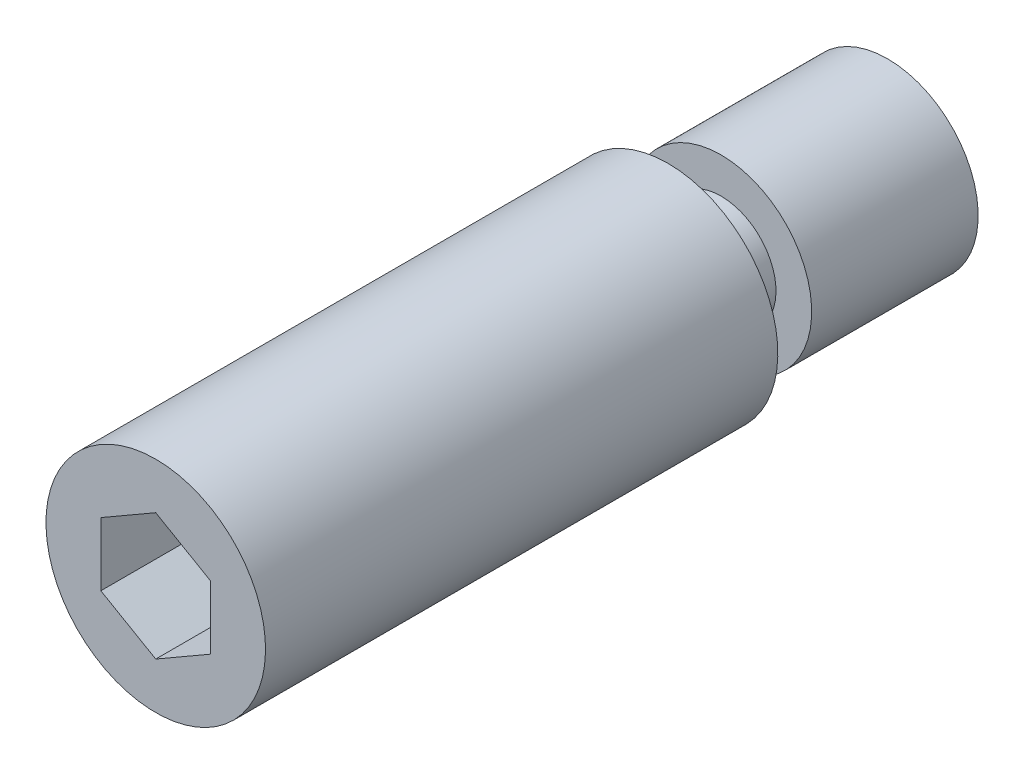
ISO-10303-21;
HEADER;
FILE_DESCRIPTION(('STEP AP214'),'2;1');
FILE_NAME('part.step','',(''),(''),'','','');
FILE_SCHEMA(('AUTOMOTIVE_DESIGN { 1 0 10303 214 1 1 1 1 }'));
ENDSEC;
DATA;
#1=APPLICATION_CONTEXT('core data for automotive mechanical design processes');
#2=APPLICATION_PROTOCOL_DEFINITION('international standard','automotive_design',2000,#1);
#3=PRODUCT_CONTEXT('',#1,'mechanical');
#4=PRODUCT('Part','Part','',(#3));
#5=PRODUCT_RELATED_PRODUCT_CATEGORY('part','',(#4));
#6=PRODUCT_DEFINITION_FORMATION('','',#4);
#7=PRODUCT_DEFINITION_CONTEXT('part definition',#1,'design');
#8=PRODUCT_DEFINITION('design','',#6,#7);
#9=PRODUCT_DEFINITION_SHAPE('','',#8);
#10=(LENGTH_UNIT() NAMED_UNIT(*) SI_UNIT(.MILLI.,.METRE.));
#11=(NAMED_UNIT(*) PLANE_ANGLE_UNIT() SI_UNIT($,.RADIAN.));
#12=(NAMED_UNIT(*) SI_UNIT($,.STERADIAN.) SOLID_ANGLE_UNIT());
#13=UNCERTAINTY_MEASURE_WITH_UNIT(LENGTH_MEASURE(1.E-05),#10,'distance_accuracy_value','');
#14=(GEOMETRIC_REPRESENTATION_CONTEXT(3) GLOBAL_UNCERTAINTY_ASSIGNED_CONTEXT((#13)) GLOBAL_UNIT_ASSIGNED_CONTEXT((#10,
#11,#12)) REPRESENTATION_CONTEXT('',''));
#15=CARTESIAN_POINT('',(0.,0.,0.));
#16=DIRECTION('',(0.,0.,1.));
#17=DIRECTION('',(1.,0.,0.));
#18=AXIS2_PLACEMENT_3D('',#15,#16,#17);
#19=CARTESIAN_POINT('',(0.,-6.,12.));
#20=DIRECTION('',(0.,0.,-1.));
#21=DIRECTION('',(0.,-1.,0.));
#22=AXIS2_PLACEMENT_3D('',#19,#20,#21);
#23=PLANE('',#22);
#24=CARTESIAN_POINT('',(0.,0.,12.));
#25=DIRECTION('',(0.,0.,1.));
#26=DIRECTION('',(0.,1.,0.));
#27=AXIS2_PLACEMENT_3D('',#24,#25,#26);
#28=CIRCLE('',#27,3.);
#29=CARTESIAN_POINT('',(0.,3.,12.));
#30=VERTEX_POINT('',#29);
#31=EDGE_CURVE('E115',#30,#30,#28,.T.);
#32=ORIENTED_EDGE('',*,*,#31,.T.);
#33=EDGE_LOOP('',(#32));
#34=FACE_BOUND('',#33,.T.);
#35=CARTESIAN_POINT('',(0.,0.,12.));
#36=DIRECTION('',(0.,0.,1.));
#37=DIRECTION('',(0.,1.,0.));
#38=AXIS2_PLACEMENT_3D('',#35,#36,#37);
#39=CIRCLE('',#38,6.);
#40=CARTESIAN_POINT('',(0.,6.,12.));
#41=VERTEX_POINT('',#40);
#42=EDGE_CURVE('E9',#41,#41,#39,.T.);
#43=ORIENTED_EDGE('',*,*,#42,.F.);
#44=EDGE_LOOP('',(#43));
#45=FACE_BOUND('',#44,.T.);
#46=ADVANCED_FACE('F14',(#34,#45),#23,.T.);
#47=CARTESIAN_POINT('',(0.,0.,20.));
#48=DIRECTION('',(0.,0.,1.));
#49=DIRECTION('',(0.,1.,0.));
#50=AXIS2_PLACEMENT_3D('',#47,#48,#49);
#51=CYLINDRICAL_SURFACE('',#50,6.);
#52=CARTESIAN_POINT('',(0.,0.,40.));
#53=DIRECTION('',(0.,0.,1.));
#54=DIRECTION('',(0.,1.,0.));
#55=AXIS2_PLACEMENT_3D('',#52,#53,#54);
#56=CIRCLE('',#55,6.);
#57=CARTESIAN_POINT('',(0.,6.,40.));
#58=VERTEX_POINT('',#57);
#59=EDGE_CURVE('E21',#58,#58,#56,.T.);
#60=ORIENTED_EDGE('',*,*,#59,.F.);
#61=EDGE_LOOP('',(#60));
#62=FACE_BOUND('',#61,.T.);
#63=ORIENTED_EDGE('',*,*,#42,.T.);
#64=EDGE_LOOP('',(#63));
#65=FACE_BOUND('',#64,.T.);
#66=ADVANCED_FACE('F136',(#62,#65),#51,.T.);
#67=CARTESIAN_POINT('',(0.,-6.,40.));
#68=DIRECTION('',(0.,0.,-1.));
#69=DIRECTION('',(0.,-1.,0.));
#70=AXIS2_PLACEMENT_3D('',#67,#68,#69);
#71=PLANE('',#70);
#72=DIRECTION('',(-0.866025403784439,-0.5,0.));
#73=VECTOR('',#72,1.);
#74=CARTESIAN_POINT('',(0.,3.46410161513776,40.));
#75=LINE('',#74,#73);
#76=CARTESIAN_POINT('',(0.,3.46410161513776,40.));
#77=VERTEX_POINT('',#76);
#78=CARTESIAN_POINT('',(-3.,1.73205080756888,40.));
#79=VERTEX_POINT('',#78);
#80=EDGE_CURVE('E102',#77,#79,#75,.T.);
#81=ORIENTED_EDGE('',*,*,#80,.F.);
#82=DIRECTION('',(-0.866025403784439,0.5,0.));
#83=VECTOR('',#82,1.);
#84=CARTESIAN_POINT('',(3.,1.73205080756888,40.));
#85=LINE('',#84,#83);
#86=CARTESIAN_POINT('',(3.,1.73205080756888,40.));
#87=VERTEX_POINT('',#86);
#88=EDGE_CURVE('E28',#87,#77,#85,.T.);
#89=ORIENTED_EDGE('',*,*,#88,.F.);
#90=DIRECTION('',(0.,1.,0.));
#91=VECTOR('',#90,1.);
#92=CARTESIAN_POINT('',(3.,-1.73205080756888,40.));
#93=LINE('',#92,#91);
#94=CARTESIAN_POINT('',(3.,-1.73205080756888,40.));
#95=VERTEX_POINT('',#94);
#96=EDGE_CURVE('E111',#95,#87,#93,.T.);
#97=ORIENTED_EDGE('',*,*,#96,.F.);
#98=DIRECTION('',(0.866025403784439,0.5,0.));
#99=VECTOR('',#98,1.);
#100=CARTESIAN_POINT('',(0.,-3.46410161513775,40.));
#101=LINE('',#100,#99);
#102=CARTESIAN_POINT('',(0.,-3.46410161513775,40.));
#103=VERTEX_POINT('',#102);
#104=EDGE_CURVE('E109',#103,#95,#101,.T.);
#105=ORIENTED_EDGE('',*,*,#104,.F.);
#106=DIRECTION('',(0.866025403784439,-0.5,0.));
#107=VECTOR('',#106,1.);
#108=CARTESIAN_POINT('',(-3.,-1.73205080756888,40.));
#109=LINE('',#108,#107);
#110=CARTESIAN_POINT('',(-3.,-1.73205080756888,40.));
#111=VERTEX_POINT('',#110);
#112=EDGE_CURVE('E76',#111,#103,#109,.T.);
#113=ORIENTED_EDGE('',*,*,#112,.F.);
#114=DIRECTION('',(0.,-1.,0.));
#115=VECTOR('',#114,1.);
#116=CARTESIAN_POINT('',(-3.,1.73205080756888,40.));
#117=LINE('',#116,#115);
#118=EDGE_CURVE('E105',#79,#111,#117,.T.);
#119=ORIENTED_EDGE('',*,*,#118,.F.);
#120=EDGE_LOOP('',(#81,#89,#97,#105,#113,#119));
#121=FACE_BOUND('',#120,.T.);
#122=ORIENTED_EDGE('',*,*,#59,.T.);
#123=EDGE_LOOP('',(#122));
#124=FACE_BOUND('',#123,.T.);
#125=ADVANCED_FACE('F134',(#121,#124),#71,.F.);
#126=CARTESIAN_POINT('',(0.,-4.95,0.));
#127=DIRECTION('',(0.,0.,-1.));
#128=DIRECTION('',(0.,-1.,0.));
#129=AXIS2_PLACEMENT_3D('',#126,#127,#128);
#130=PLANE('',#129);
#131=CARTESIAN_POINT('',(0.,0.,0.));
#132=DIRECTION('',(0.,0.,1.));
#133=DIRECTION('',(0.,1.,0.));
#134=AXIS2_PLACEMENT_3D('',#131,#132,#133);
#135=CIRCLE('',#134,4.95);
#136=CARTESIAN_POINT('',(0.,4.95,0.));
#137=VERTEX_POINT('',#136);
#138=EDGE_CURVE('E129',#137,#137,#135,.T.);
#139=ORIENTED_EDGE('',*,*,#138,.F.);
#140=EDGE_LOOP('',(#139));
#141=FACE_BOUND('',#140,.T.);
#142=ADVANCED_FACE('F167',(#141),#130,.T.);
#143=CARTESIAN_POINT('',(0.,0.,20.));
#144=DIRECTION('',(0.,0.,1.));
#145=DIRECTION('',(0.,1.,0.));
#146=AXIS2_PLACEMENT_3D('',#143,#144,#145);
#147=CYLINDRICAL_SURFACE('',#146,4.95);
#148=ORIENTED_EDGE('',*,*,#138,.T.);
#149=EDGE_LOOP('',(#148));
#150=FACE_BOUND('',#149,.T.);
#151=CARTESIAN_POINT('',(0.,0.,9.1));
#152=DIRECTION('',(0.,0.,1.));
#153=DIRECTION('',(0.,1.,0.));
#154=AXIS2_PLACEMENT_3D('',#151,#152,#153);
#155=CIRCLE('',#154,4.95);
#156=CARTESIAN_POINT('',(0.,4.95,9.1));
#157=VERTEX_POINT('',#156);
#158=EDGE_CURVE('E126',#157,#157,#155,.T.);
#159=ORIENTED_EDGE('',*,*,#158,.F.);
#160=EDGE_LOOP('',(#159));
#161=FACE_BOUND('',#160,.T.);
#162=ADVANCED_FACE('F160',(#150,#161),#147,.T.);
#163=CARTESIAN_POINT('',(0.,-3.,9.1));
#164=DIRECTION('',(0.,0.,1.));
#165=DIRECTION('',(0.,1.,0.));
#166=AXIS2_PLACEMENT_3D('',#163,#164,#165);
#167=PLANE('',#166);
#168=ORIENTED_EDGE('',*,*,#158,.T.);
#169=EDGE_LOOP('',(#168));
#170=FACE_BOUND('',#169,.T.);
#171=CARTESIAN_POINT('',(0.,0.,9.1));
#172=DIRECTION('',(0.,0.,1.));
#173=DIRECTION('',(0.,1.,0.));
#174=AXIS2_PLACEMENT_3D('',#171,#172,#173);
#175=CIRCLE('',#174,3.);
#176=CARTESIAN_POINT('',(0.,3.,9.1));
#177=VERTEX_POINT('',#176);
#178=EDGE_CURVE('E123',#177,#177,#175,.T.);
#179=ORIENTED_EDGE('',*,*,#178,.F.);
#180=EDGE_LOOP('',(#179));
#181=FACE_BOUND('',#180,.T.);
#182=ADVANCED_FACE('F151',(#170,#181),#167,.T.);
#183=CARTESIAN_POINT('',(0.,0.,20.));
#184=DIRECTION('',(0.,0.,1.));
#185=DIRECTION('',(0.,1.,0.));
#186=AXIS2_PLACEMENT_3D('',#183,#184,#185);
#187=CYLINDRICAL_SURFACE('',#186,3.);
#188=ORIENTED_EDGE('',*,*,#178,.T.);
#189=EDGE_LOOP('',(#188));
#190=FACE_BOUND('',#189,.T.);
#191=ORIENTED_EDGE('',*,*,#31,.F.);
#192=EDGE_LOOP('',(#191));
#193=FACE_BOUND('',#192,.T.);
#194=ADVANCED_FACE('F148',(#190,#193),#187,.T.);
#195=CARTESIAN_POINT('',(3.,1.73205080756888,32.));
#196=DIRECTION('',(0.5,0.866025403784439,0.));
#197=DIRECTION('',(-0.866025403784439,0.5,0.));
#198=AXIS2_PLACEMENT_3D('',#195,#196,#197);
#199=PLANE('',#198);
#200=ORIENTED_EDGE('',*,*,#88,.T.);
#201=DIRECTION('',(0.,0.,1.));
#202=VECTOR('',#201,1.);
#203=CARTESIAN_POINT('',(0.,3.46410161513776,32.));
#204=LINE('',#203,#202);
#205=CARTESIAN_POINT('',(0.,3.46410161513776,32.));
#206=VERTEX_POINT('',#205);
#207=EDGE_CURVE('E58',#206,#77,#204,.T.);
#208=ORIENTED_EDGE('',*,*,#207,.F.);
#209=DIRECTION('',(-0.866025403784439,0.5,0.));
#210=VECTOR('',#209,1.);
#211=CARTESIAN_POINT('',(3.,1.73205080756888,32.));
#212=LINE('',#211,#210);
#213=CARTESIAN_POINT('',(3.,1.73205080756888,32.));
#214=VERTEX_POINT('',#213);
#215=EDGE_CURVE('E113',#214,#206,#212,.T.);
#216=ORIENTED_EDGE('',*,*,#215,.F.);
#217=DIRECTION('',(0.,0.,1.));
#218=VECTOR('',#217,1.);
#219=CARTESIAN_POINT('',(3.,1.73205080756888,32.));
#220=LINE('',#219,#218);
#221=EDGE_CURVE('E36',#214,#87,#220,.T.);
#222=ORIENTED_EDGE('',*,*,#221,.T.);
#223=EDGE_LOOP('',(#200,#208,#216,#222));
#224=FACE_BOUND('',#223,.T.);
#225=ADVANCED_FACE('F150',(#224),#199,.F.);
#226=CARTESIAN_POINT('',(3.,-1.73205080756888,32.));
#227=DIRECTION('',(1.,0.,0.));
#228=DIRECTION('',(0.,0.,-1.));
#229=AXIS2_PLACEMENT_3D('',#226,#227,#228);
#230=PLANE('',#229);
#231=ORIENTED_EDGE('',*,*,#96,.T.);
#232=ORIENTED_EDGE('',*,*,#221,.F.);
#233=DIRECTION('',(0.,1.,0.));
#234=VECTOR('',#233,1.);
#235=CARTESIAN_POINT('',(3.,-1.73205080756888,32.));
#236=LINE('',#235,#234);
#237=CARTESIAN_POINT('',(3.,-1.73205080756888,32.));
#238=VERTEX_POINT('',#237);
#239=EDGE_CURVE('E88',#238,#214,#236,.T.);
#240=ORIENTED_EDGE('',*,*,#239,.F.);
#241=DIRECTION('',(0.,0.,1.));
#242=VECTOR('',#241,1.);
#243=CARTESIAN_POINT('',(3.,-1.73205080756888,32.));
#244=LINE('',#243,#242);
#245=EDGE_CURVE('E80',#238,#95,#244,.T.);
#246=ORIENTED_EDGE('',*,*,#245,.T.);
#247=EDGE_LOOP('',(#231,#232,#240,#246));
#248=FACE_BOUND('',#247,.T.);
#249=ADVANCED_FACE('F158',(#248),#230,.F.);
#250=CARTESIAN_POINT('',(0.,-3.46410161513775,32.));
#251=DIRECTION('',(0.5,-0.866025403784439,0.));
#252=DIRECTION('',(0.866025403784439,0.5,0.));
#253=AXIS2_PLACEMENT_3D('',#250,#251,#252);
#254=PLANE('',#253);
#255=ORIENTED_EDGE('',*,*,#104,.T.);
#256=ORIENTED_EDGE('',*,*,#245,.F.);
#257=DIRECTION('',(0.866025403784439,0.5,0.));
#258=VECTOR('',#257,1.);
#259=CARTESIAN_POINT('',(0.,-3.46410161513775,32.));
#260=LINE('',#259,#258);
#261=CARTESIAN_POINT('',(0.,-3.46410161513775,32.));
#262=VERTEX_POINT('',#261);
#263=EDGE_CURVE('E84',#262,#238,#260,.T.);
#264=ORIENTED_EDGE('',*,*,#263,.F.);
#265=DIRECTION('',(0.,0.,1.));
#266=VECTOR('',#265,1.);
#267=CARTESIAN_POINT('',(0.,-3.46410161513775,32.));
#268=LINE('',#267,#266);
#269=EDGE_CURVE('E69',#262,#103,#268,.T.);
#270=ORIENTED_EDGE('',*,*,#269,.T.);
#271=EDGE_LOOP('',(#255,#256,#264,#270));
#272=FACE_BOUND('',#271,.T.);
#273=ADVANCED_FACE('F85',(#272),#254,.F.);
#274=CARTESIAN_POINT('',(-3.,-1.73205080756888,32.));
#275=DIRECTION('',(-0.5,-0.866025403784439,0.));
#276=DIRECTION('',(0.866025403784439,-0.5,0.));
#277=AXIS2_PLACEMENT_3D('',#274,#275,#276);
#278=PLANE('',#277);
#279=ORIENTED_EDGE('',*,*,#112,.T.);
#280=ORIENTED_EDGE('',*,*,#269,.F.);
#281=DIRECTION('',(0.866025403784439,-0.5,0.));
#282=VECTOR('',#281,1.);
#283=CARTESIAN_POINT('',(-3.,-1.73205080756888,32.));
#284=LINE('',#283,#282);
#285=CARTESIAN_POINT('',(-3.,-1.73205080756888,32.));
#286=VERTEX_POINT('',#285);
#287=EDGE_CURVE('E73',#286,#262,#284,.T.);
#288=ORIENTED_EDGE('',*,*,#287,.F.);
#289=DIRECTION('',(0.,0.,1.));
#290=VECTOR('',#289,1.);
#291=CARTESIAN_POINT('',(-3.,-1.73205080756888,32.));
#292=LINE('',#291,#290);
#293=EDGE_CURVE('E81',#286,#111,#292,.T.);
#294=ORIENTED_EDGE('',*,*,#293,.T.);
#295=EDGE_LOOP('',(#279,#280,#288,#294));
#296=FACE_BOUND('',#295,.T.);
#297=ADVANCED_FACE('F71',(#296),#278,.F.);
#298=CARTESIAN_POINT('',(-3.,1.73205080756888,32.));
#299=DIRECTION('',(-1.,0.,0.));
#300=DIRECTION('',(0.,-1.,0.));
#301=AXIS2_PLACEMENT_3D('',#298,#299,#300);
#302=PLANE('',#301);
#303=ORIENTED_EDGE('',*,*,#118,.T.);
#304=ORIENTED_EDGE('',*,*,#293,.F.);
#305=DIRECTION('',(0.,-1.,0.));
#306=VECTOR('',#305,1.);
#307=CARTESIAN_POINT('',(-3.,1.73205080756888,32.));
#308=LINE('',#307,#306);
#309=CARTESIAN_POINT('',(-3.,1.73205080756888,32.));
#310=VERTEX_POINT('',#309);
#311=EDGE_CURVE('E94',#310,#286,#308,.T.);
#312=ORIENTED_EDGE('',*,*,#311,.F.);
#313=DIRECTION('',(0.,0.,1.));
#314=VECTOR('',#313,1.);
#315=CARTESIAN_POINT('',(-3.,1.73205080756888,32.));
#316=LINE('',#315,#314);
#317=EDGE_CURVE('E118',#310,#79,#316,.T.);
#318=ORIENTED_EDGE('',*,*,#317,.T.);
#319=EDGE_LOOP('',(#303,#304,#312,#318));
#320=FACE_BOUND('',#319,.T.);
#321=ADVANCED_FACE('F192',(#320),#302,.F.);
#322=CARTESIAN_POINT('',(0.,3.46410161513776,32.));
#323=DIRECTION('',(-0.5,0.866025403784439,0.));
#324=DIRECTION('',(-0.866025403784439,-0.5,0.));
#325=AXIS2_PLACEMENT_3D('',#322,#323,#324);
#326=PLANE('',#325);
#327=ORIENTED_EDGE('',*,*,#80,.T.);
#328=ORIENTED_EDGE('',*,*,#317,.F.);
#329=DIRECTION('',(-0.866025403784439,-0.5,0.));
#330=VECTOR('',#329,1.);
#331=CARTESIAN_POINT('',(0.,3.46410161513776,32.));
#332=LINE('',#331,#330);
#333=EDGE_CURVE('E96',#206,#310,#332,.T.);
#334=ORIENTED_EDGE('',*,*,#333,.F.);
#335=ORIENTED_EDGE('',*,*,#207,.T.);
#336=EDGE_LOOP('',(#327,#328,#334,#335));
#337=FACE_BOUND('',#336,.T.);
#338=ADVANCED_FACE('F180',(#337),#326,.F.);
#339=CARTESIAN_POINT('',(0.,3.46410161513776,32.));
#340=DIRECTION('',(0.,0.,1.));
#341=DIRECTION('',(1.,0.,0.));
#342=AXIS2_PLACEMENT_3D('',#339,#340,#341);
#343=PLANE('',#342);
#344=ORIENTED_EDGE('',*,*,#215,.T.);
#345=ORIENTED_EDGE('',*,*,#333,.T.);
#346=ORIENTED_EDGE('',*,*,#311,.T.);
#347=ORIENTED_EDGE('',*,*,#287,.T.);
#348=ORIENTED_EDGE('',*,*,#263,.T.);
#349=ORIENTED_EDGE('',*,*,#239,.T.);
#350=EDGE_LOOP('',(#344,#345,#346,#347,#348,#349));
#351=FACE_BOUND('',#350,.T.);
#352=ADVANCED_FACE('F91',(#351),#343,.T.);
#353=CLOSED_SHELL('',(#46,#66,#125,#142,#162,#182,#194,#225,#249,#273,#297,#321,#338,#352));
#354=MANIFOLD_SOLID_BREP('B1',#353);
#355=ADVANCED_BREP_SHAPE_REPRESENTATION('',(#18,#354),#14);
#356=SHAPE_DEFINITION_REPRESENTATION(#9,#355);
ENDSEC;
END-ISO-10303-21;
